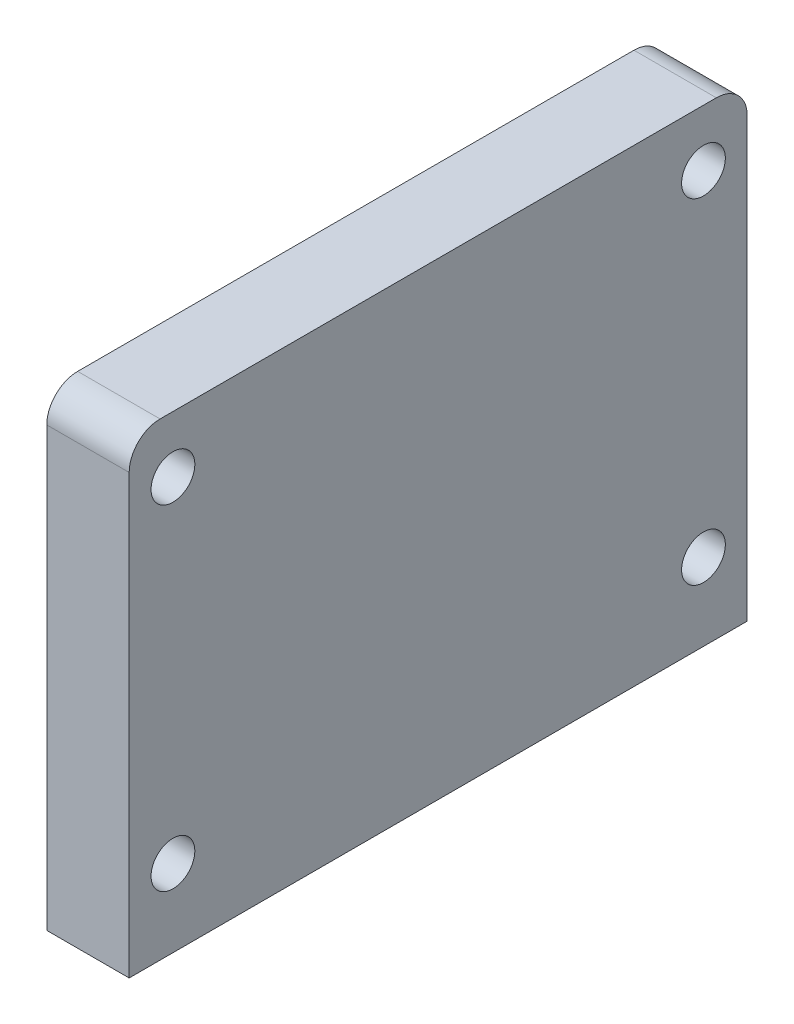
ISO-10303-21;
HEADER;
FILE_DESCRIPTION(('STEP AP214'),'2;1');
FILE_NAME('part.step','',(''),(''),'','','');
FILE_SCHEMA(('AUTOMOTIVE_DESIGN { 1 0 10303 214 1 1 1 1 }'));
ENDSEC;
DATA;
#1=APPLICATION_CONTEXT('core data for automotive mechanical design processes');
#2=APPLICATION_PROTOCOL_DEFINITION('international standard','automotive_design',2000,#1);
#3=PRODUCT_CONTEXT('',#1,'mechanical');
#4=PRODUCT('Part','Part','',(#3));
#5=PRODUCT_RELATED_PRODUCT_CATEGORY('part','',(#4));
#6=PRODUCT_DEFINITION_FORMATION('','',#4);
#7=PRODUCT_DEFINITION_CONTEXT('part definition',#1,'design');
#8=PRODUCT_DEFINITION('design','',#6,#7);
#9=PRODUCT_DEFINITION_SHAPE('','',#8);
#10=(LENGTH_UNIT() NAMED_UNIT(*) SI_UNIT(.MILLI.,.METRE.));
#11=(NAMED_UNIT(*) PLANE_ANGLE_UNIT() SI_UNIT($,.RADIAN.));
#12=(NAMED_UNIT(*) SI_UNIT($,.STERADIAN.) SOLID_ANGLE_UNIT());
#13=UNCERTAINTY_MEASURE_WITH_UNIT(LENGTH_MEASURE(1.E-05),#10,'distance_accuracy_value','');
#14=(GEOMETRIC_REPRESENTATION_CONTEXT(3) GLOBAL_UNCERTAINTY_ASSIGNED_CONTEXT((#13)) GLOBAL_UNIT_ASSIGNED_CONTEXT((#10,
#11,#12)) REPRESENTATION_CONTEXT('',''));
#15=CARTESIAN_POINT('',(0.,0.,0.));
#16=DIRECTION('',(0.,0.,1.));
#17=DIRECTION('',(1.,0.,0.));
#18=AXIS2_PLACEMENT_3D('',#15,#16,#17);
#19=CARTESIAN_POINT('',(-16.,37.,-54.));
#20=DIRECTION('',(1.,0.,0.));
#21=DIRECTION('',(0.,0.,-1.));
#22=AXIS2_PLACEMENT_3D('',#19,#20,#21);
#23=CYLINDRICAL_SURFACE('',#22,6.);
#24=CARTESIAN_POINT('',(0.,37.,-54.));
#25=DIRECTION('',(-1.,0.,0.));
#26=DIRECTION('',(0.,0.,1.));
#27=AXIS2_PLACEMENT_3D('',#24,#25,#26);
#28=CIRCLE('',#27,6.);
#29=CARTESIAN_POINT('',(0.,43.,-54.));
#30=VERTEX_POINT('',#29);
#31=CARTESIAN_POINT('',(0.,37.,-60.));
#32=VERTEX_POINT('',#31);
#33=EDGE_CURVE('E117',#30,#32,#28,.T.);
#34=ORIENTED_EDGE('',*,*,#33,.T.);
#35=DIRECTION('',(1.,0.,0.));
#36=VECTOR('',#35,1.);
#37=CARTESIAN_POINT('',(-16.,37.,-60.));
#38=LINE('',#37,#36);
#39=CARTESIAN_POINT('',(-16.,37.,-60.));
#40=VERTEX_POINT('',#39);
#41=EDGE_CURVE('E11',#40,#32,#38,.T.);
#42=ORIENTED_EDGE('',*,*,#41,.F.);
#43=CARTESIAN_POINT('',(-16.,37.,-54.));
#44=DIRECTION('',(-1.,0.,0.));
#45=DIRECTION('',(0.,0.,1.));
#46=AXIS2_PLACEMENT_3D('',#43,#44,#45);
#47=CIRCLE('',#46,6.);
#48=CARTESIAN_POINT('',(-16.,43.,-54.));
#49=VERTEX_POINT('',#48);
#50=EDGE_CURVE('E128',#49,#40,#47,.T.);
#51=ORIENTED_EDGE('',*,*,#50,.F.);
#52=DIRECTION('',(1.,0.,0.));
#53=VECTOR('',#52,1.);
#54=CARTESIAN_POINT('',(-16.,43.,-54.));
#55=LINE('',#54,#53);
#56=EDGE_CURVE('E113',#49,#30,#55,.T.);
#57=ORIENTED_EDGE('',*,*,#56,.T.);
#58=EDGE_LOOP('',(#34,#42,#51,#57));
#59=FACE_BOUND('',#58,.T.);
#60=ADVANCED_FACE('F33',(#59),#23,.T.);
#61=CARTESIAN_POINT('',(-16.,37.,-60.));
#62=DIRECTION('',(0.,0.,1.));
#63=DIRECTION('',(1.,0.,0.));
#64=AXIS2_PLACEMENT_3D('',#61,#62,#63);
#65=PLANE('',#64);
#66=DIRECTION('',(0.,-1.,0.));
#67=VECTOR('',#66,1.);
#68=CARTESIAN_POINT('',(0.,37.,-60.));
#69=LINE('',#68,#67);
#70=CARTESIAN_POINT('',(0.,-48.,-60.));
#71=VERTEX_POINT('',#70);
#72=EDGE_CURVE('E120',#32,#71,#69,.T.);
#73=ORIENTED_EDGE('',*,*,#72,.T.);
#74=DIRECTION('',(1.,0.,0.));
#75=VECTOR('',#74,1.);
#76=CARTESIAN_POINT('',(-16.,-48.,-60.));
#77=LINE('',#76,#75);
#78=CARTESIAN_POINT('',(-16.,-48.,-60.));
#79=VERTEX_POINT('',#78);
#80=EDGE_CURVE('E41',#79,#71,#77,.T.);
#81=ORIENTED_EDGE('',*,*,#80,.F.);
#82=DIRECTION('',(0.,-1.,0.));
#83=VECTOR('',#82,1.);
#84=CARTESIAN_POINT('',(-16.,37.,-60.));
#85=LINE('',#84,#83);
#86=EDGE_CURVE('E86',#40,#79,#85,.T.);
#87=ORIENTED_EDGE('',*,*,#86,.F.);
#88=ORIENTED_EDGE('',*,*,#41,.T.);
#89=EDGE_LOOP('',(#73,#81,#87,#88));
#90=FACE_BOUND('',#89,.T.);
#91=ADVANCED_FACE('F153',(#90),#65,.F.);
#92=CARTESIAN_POINT('',(-16.,-48.,60.));
#93=DIRECTION('',(0.,1.,0.));
#94=DIRECTION('',(0.,0.,1.));
#95=AXIS2_PLACEMENT_3D('',#92,#93,#94);
#96=PLANE('',#95);
#97=DIRECTION('',(0.,0.,1.));
#98=VECTOR('',#97,1.);
#99=CARTESIAN_POINT('',(0.,-48.,60.));
#100=LINE('',#99,#98);
#101=CARTESIAN_POINT('',(0.,-48.,60.));
#102=VERTEX_POINT('',#101);
#103=EDGE_CURVE('E123',#71,#102,#100,.T.);
#104=ORIENTED_EDGE('',*,*,#103,.T.);
#105=DIRECTION('',(1.,0.,0.));
#106=VECTOR('',#105,1.);
#107=CARTESIAN_POINT('',(-16.,-48.,60.));
#108=LINE('',#107,#106);
#109=CARTESIAN_POINT('',(-16.,-48.,60.));
#110=VERTEX_POINT('',#109);
#111=EDGE_CURVE('E108',#110,#102,#108,.T.);
#112=ORIENTED_EDGE('',*,*,#111,.F.);
#113=DIRECTION('',(0.,0.,1.));
#114=VECTOR('',#113,1.);
#115=CARTESIAN_POINT('',(-16.,-48.,60.));
#116=LINE('',#115,#114);
#117=EDGE_CURVE('E99',#79,#110,#116,.T.);
#118=ORIENTED_EDGE('',*,*,#117,.F.);
#119=ORIENTED_EDGE('',*,*,#80,.T.);
#120=EDGE_LOOP('',(#104,#112,#118,#119));
#121=FACE_BOUND('',#120,.T.);
#122=ADVANCED_FACE('F134',(#121),#96,.F.);
#123=CARTESIAN_POINT('',(-16.,37.,60.));
#124=DIRECTION('',(0.,0.,-1.));
#125=DIRECTION('',(-1.,0.,0.));
#126=AXIS2_PLACEMENT_3D('',#123,#124,#125);
#127=PLANE('',#126);
#128=DIRECTION('',(0.,1.,0.));
#129=VECTOR('',#128,1.);
#130=CARTESIAN_POINT('',(0.,37.,60.));
#131=LINE('',#130,#129);
#132=CARTESIAN_POINT('',(0.,37.,60.));
#133=VERTEX_POINT('',#132);
#134=EDGE_CURVE('E107',#102,#133,#131,.T.);
#135=ORIENTED_EDGE('',*,*,#134,.T.);
#136=DIRECTION('',(1.,0.,0.));
#137=VECTOR('',#136,1.);
#138=CARTESIAN_POINT('',(-16.,37.,60.));
#139=LINE('',#138,#137);
#140=CARTESIAN_POINT('',(-16.,37.,60.));
#141=VERTEX_POINT('',#140);
#142=EDGE_CURVE('E104',#141,#133,#139,.T.);
#143=ORIENTED_EDGE('',*,*,#142,.F.);
#144=DIRECTION('',(0.,1.,0.));
#145=VECTOR('',#144,1.);
#146=CARTESIAN_POINT('',(-16.,37.,60.));
#147=LINE('',#146,#145);
#148=EDGE_CURVE('E93',#110,#141,#147,.T.);
#149=ORIENTED_EDGE('',*,*,#148,.F.);
#150=ORIENTED_EDGE('',*,*,#111,.T.);
#151=EDGE_LOOP('',(#135,#143,#149,#150));
#152=FACE_BOUND('',#151,.T.);
#153=ADVANCED_FACE('F105',(#152),#127,.F.);
#154=CARTESIAN_POINT('',(-16.,37.,54.));
#155=DIRECTION('',(1.,0.,0.));
#156=DIRECTION('',(0.,0.,-1.));
#157=AXIS2_PLACEMENT_3D('',#154,#155,#156);
#158=CYLINDRICAL_SURFACE('',#157,6.);
#159=CARTESIAN_POINT('',(0.,37.,54.));
#160=DIRECTION('',(-1.,0.,0.));
#161=DIRECTION('',(0.,0.,1.));
#162=AXIS2_PLACEMENT_3D('',#159,#160,#161);
#163=CIRCLE('',#162,6.);
#164=CARTESIAN_POINT('',(0.,43.,54.));
#165=VERTEX_POINT('',#164);
#166=EDGE_CURVE('E72',#133,#165,#163,.T.);
#167=ORIENTED_EDGE('',*,*,#166,.T.);
#168=DIRECTION('',(1.,0.,0.));
#169=VECTOR('',#168,1.);
#170=CARTESIAN_POINT('',(-16.,43.,54.));
#171=LINE('',#170,#169);
#172=CARTESIAN_POINT('',(-16.,43.,54.));
#173=VERTEX_POINT('',#172);
#174=EDGE_CURVE('E109',#173,#165,#171,.T.);
#175=ORIENTED_EDGE('',*,*,#174,.F.);
#176=CARTESIAN_POINT('',(-16.,37.,54.));
#177=DIRECTION('',(-1.,0.,0.));
#178=DIRECTION('',(0.,0.,1.));
#179=AXIS2_PLACEMENT_3D('',#176,#177,#178);
#180=CIRCLE('',#179,6.);
#181=EDGE_CURVE('E97',#141,#173,#180,.T.);
#182=ORIENTED_EDGE('',*,*,#181,.F.);
#183=ORIENTED_EDGE('',*,*,#142,.T.);
#184=EDGE_LOOP('',(#167,#175,#182,#183));
#185=FACE_BOUND('',#184,.T.);
#186=ADVANCED_FACE('F111',(#185),#158,.T.);
#187=CARTESIAN_POINT('',(-16.,43.,54.));
#188=DIRECTION('',(0.,-1.,0.));
#189=DIRECTION('',(0.,0.,-1.));
#190=AXIS2_PLACEMENT_3D('',#187,#188,#189);
#191=PLANE('',#190);
#192=DIRECTION('',(0.,0.,-1.));
#193=VECTOR('',#192,1.);
#194=CARTESIAN_POINT('',(0.,43.,54.));
#195=LINE('',#194,#193);
#196=EDGE_CURVE('E78',#165,#30,#195,.T.);
#197=ORIENTED_EDGE('',*,*,#196,.T.);
#198=ORIENTED_EDGE('',*,*,#56,.F.);
#199=DIRECTION('',(0.,0.,-1.));
#200=VECTOR('',#199,1.);
#201=CARTESIAN_POINT('',(-16.,43.,54.));
#202=LINE('',#201,#200);
#203=EDGE_CURVE('E49',#173,#49,#202,.T.);
#204=ORIENTED_EDGE('',*,*,#203,.F.);
#205=ORIENTED_EDGE('',*,*,#174,.T.);
#206=EDGE_LOOP('',(#197,#198,#204,#205));
#207=FACE_BOUND('',#206,.T.);
#208=ADVANCED_FACE('F141',(#207),#191,.F.);
#209=CARTESIAN_POINT('',(-16.,37.,-54.));
#210=DIRECTION('',(-1.,0.,0.));
#211=DIRECTION('',(0.,0.,1.));
#212=AXIS2_PLACEMENT_3D('',#209,#210,#211);
#213=PLANE('',#212);
#214=CARTESIAN_POINT('',(-16.,32.,51.5));
#215=DIRECTION('',(-1.,0.,0.));
#216=DIRECTION('',(0.,0.,1.));
#217=AXIS2_PLACEMENT_3D('',#214,#215,#216);
#218=CIRCLE('',#217,4.25);
#219=CARTESIAN_POINT('',(-16.,32.,55.75));
#220=VERTEX_POINT('',#219);
#221=EDGE_CURVE('E236',#220,#220,#218,.T.);
#222=ORIENTED_EDGE('',*,*,#221,.F.);
#223=EDGE_LOOP('',(#222));
#224=FACE_BOUND('',#223,.T.);
#225=CARTESIAN_POINT('',(-16.,-33.,51.5));
#226=DIRECTION('',(-1.,0.,0.));
#227=DIRECTION('',(0.,0.,1.));
#228=AXIS2_PLACEMENT_3D('',#225,#226,#227);
#229=CIRCLE('',#228,4.24999999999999);
#230=CARTESIAN_POINT('',(-16.,-33.,55.75));
#231=VERTEX_POINT('',#230);
#232=EDGE_CURVE('E246',#231,#231,#229,.T.);
#233=ORIENTED_EDGE('',*,*,#232,.F.);
#234=EDGE_LOOP('',(#233));
#235=FACE_BOUND('',#234,.T.);
#236=CARTESIAN_POINT('',(-16.,32.,-51.5));
#237=DIRECTION('',(-1.,0.,0.));
#238=DIRECTION('',(0.,0.,1.));
#239=AXIS2_PLACEMENT_3D('',#236,#237,#238);
#240=CIRCLE('',#239,4.25);
#241=CARTESIAN_POINT('',(-16.,32.,-47.25));
#242=VERTEX_POINT('',#241);
#243=EDGE_CURVE('E252',#242,#242,#240,.T.);
#244=ORIENTED_EDGE('',*,*,#243,.F.);
#245=EDGE_LOOP('',(#244));
#246=FACE_BOUND('',#245,.T.);
#247=CARTESIAN_POINT('',(-16.,-33.,-51.5));
#248=DIRECTION('',(-1.,0.,0.));
#249=DIRECTION('',(0.,0.,1.));
#250=AXIS2_PLACEMENT_3D('',#247,#248,#249);
#251=CIRCLE('',#250,4.24999999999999);
#252=CARTESIAN_POINT('',(-16.,-33.,-47.25));
#253=VERTEX_POINT('',#252);
#254=EDGE_CURVE('E121',#253,#253,#251,.T.);
#255=ORIENTED_EDGE('',*,*,#254,.F.);
#256=EDGE_LOOP('',(#255));
#257=FACE_BOUND('',#256,.T.);
#258=ORIENTED_EDGE('',*,*,#50,.T.);
#259=ORIENTED_EDGE('',*,*,#86,.T.);
#260=ORIENTED_EDGE('',*,*,#117,.T.);
#261=ORIENTED_EDGE('',*,*,#148,.T.);
#262=ORIENTED_EDGE('',*,*,#181,.T.);
#263=ORIENTED_EDGE('',*,*,#203,.T.);
#264=EDGE_LOOP('',(#258,#259,#260,#261,#262,#263));
#265=FACE_BOUND('',#264,.T.);
#266=ADVANCED_FACE('F95',(#224,#235,#246,#257,#265),#213,.T.);
#267=CARTESIAN_POINT('',(0.,37.,-54.));
#268=DIRECTION('',(-1.,0.,0.));
#269=DIRECTION('',(0.,0.,1.));
#270=AXIS2_PLACEMENT_3D('',#267,#268,#269);
#271=PLANE('',#270);
#272=CARTESIAN_POINT('',(0.,32.,51.5));
#273=DIRECTION('',(1.,0.,0.));
#274=DIRECTION('',(0.,0.,-1.));
#275=AXIS2_PLACEMENT_3D('',#272,#273,#274);
#276=CIRCLE('',#275,4.25);
#277=CARTESIAN_POINT('',(0.,32.,47.25));
#278=VERTEX_POINT('',#277);
#279=EDGE_CURVE('E239',#278,#278,#276,.T.);
#280=ORIENTED_EDGE('',*,*,#279,.F.);
#281=EDGE_LOOP('',(#280));
#282=FACE_BOUND('',#281,.T.);
#283=CARTESIAN_POINT('',(0.,-33.,51.5));
#284=DIRECTION('',(1.,0.,0.));
#285=DIRECTION('',(0.,0.,-1.));
#286=AXIS2_PLACEMENT_3D('',#283,#284,#285);
#287=CIRCLE('',#286,4.25);
#288=CARTESIAN_POINT('',(0.,-33.,47.25));
#289=VERTEX_POINT('',#288);
#290=EDGE_CURVE('E241',#289,#289,#287,.T.);
#291=ORIENTED_EDGE('',*,*,#290,.F.);
#292=EDGE_LOOP('',(#291));
#293=FACE_BOUND('',#292,.T.);
#294=CARTESIAN_POINT('',(0.,32.,-51.5));
#295=DIRECTION('',(1.,0.,0.));
#296=DIRECTION('',(0.,0.,-1.));
#297=AXIS2_PLACEMENT_3D('',#294,#295,#296);
#298=CIRCLE('',#297,4.25);
#299=CARTESIAN_POINT('',(0.,32.,-55.75));
#300=VERTEX_POINT('',#299);
#301=EDGE_CURVE('E249',#300,#300,#298,.T.);
#302=ORIENTED_EDGE('',*,*,#301,.F.);
#303=EDGE_LOOP('',(#302));
#304=FACE_BOUND('',#303,.T.);
#305=CARTESIAN_POINT('',(0.,-33.,-51.5));
#306=DIRECTION('',(1.,0.,0.));
#307=DIRECTION('',(0.,0.,-1.));
#308=AXIS2_PLACEMENT_3D('',#305,#306,#307);
#309=CIRCLE('',#308,4.25);
#310=CARTESIAN_POINT('',(0.,-33.,-55.75));
#311=VERTEX_POINT('',#310);
#312=EDGE_CURVE('E255',#311,#311,#309,.T.);
#313=ORIENTED_EDGE('',*,*,#312,.F.);
#314=EDGE_LOOP('',(#313));
#315=FACE_BOUND('',#314,.T.);
#316=ORIENTED_EDGE('',*,*,#33,.F.);
#317=ORIENTED_EDGE('',*,*,#196,.F.);
#318=ORIENTED_EDGE('',*,*,#166,.F.);
#319=ORIENTED_EDGE('',*,*,#134,.F.);
#320=ORIENTED_EDGE('',*,*,#103,.F.);
#321=ORIENTED_EDGE('',*,*,#72,.F.);
#322=EDGE_LOOP('',(#316,#317,#318,#319,#320,#321));
#323=FACE_BOUND('',#322,.T.);
#324=ADVANCED_FACE('F137',(#282,#293,#304,#315,#323),#271,.F.);
#325=CARTESIAN_POINT('',(0.,-33.,-51.5));
#326=DIRECTION('',(1.,0.,0.));
#327=DIRECTION('',(0.,0.,-1.));
#328=AXIS2_PLACEMENT_3D('',#325,#326,#327);
#329=CYLINDRICAL_SURFACE('',#328,4.24999999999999);
#330=ORIENTED_EDGE('',*,*,#254,.T.);
#331=EDGE_LOOP('',(#330));
#332=FACE_BOUND('',#331,.T.);
#333=ORIENTED_EDGE('',*,*,#312,.T.);
#334=EDGE_LOOP('',(#333));
#335=FACE_BOUND('',#334,.T.);
#336=ADVANCED_FACE('F190',(#332,#335),#329,.F.);
#337=CARTESIAN_POINT('',(0.,32.,-51.5));
#338=DIRECTION('',(1.,0.,0.));
#339=DIRECTION('',(0.,0.,-1.));
#340=AXIS2_PLACEMENT_3D('',#337,#338,#339);
#341=CYLINDRICAL_SURFACE('',#340,4.25);
#342=ORIENTED_EDGE('',*,*,#243,.T.);
#343=EDGE_LOOP('',(#342));
#344=FACE_BOUND('',#343,.T.);
#345=ORIENTED_EDGE('',*,*,#301,.T.);
#346=EDGE_LOOP('',(#345));
#347=FACE_BOUND('',#346,.T.);
#348=ADVANCED_FACE('F199',(#344,#347),#341,.F.);
#349=CARTESIAN_POINT('',(0.,-33.,51.5));
#350=DIRECTION('',(1.,0.,0.));
#351=DIRECTION('',(0.,0.,-1.));
#352=AXIS2_PLACEMENT_3D('',#349,#350,#351);
#353=CYLINDRICAL_SURFACE('',#352,4.24999999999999);
#354=ORIENTED_EDGE('',*,*,#232,.T.);
#355=EDGE_LOOP('',(#354));
#356=FACE_BOUND('',#355,.T.);
#357=ORIENTED_EDGE('',*,*,#290,.T.);
#358=EDGE_LOOP('',(#357));
#359=FACE_BOUND('',#358,.T.);
#360=ADVANCED_FACE('F209',(#356,#359),#353,.F.);
#361=CARTESIAN_POINT('',(0.,32.,51.5));
#362=DIRECTION('',(1.,0.,0.));
#363=DIRECTION('',(0.,0.,-1.));
#364=AXIS2_PLACEMENT_3D('',#361,#362,#363);
#365=CYLINDRICAL_SURFACE('',#364,4.25);
#366=ORIENTED_EDGE('',*,*,#221,.T.);
#367=EDGE_LOOP('',(#366));
#368=FACE_BOUND('',#367,.T.);
#369=ORIENTED_EDGE('',*,*,#279,.T.);
#370=EDGE_LOOP('',(#369));
#371=FACE_BOUND('',#370,.T.);
#372=ADVANCED_FACE('F219',(#368,#371),#365,.F.);
#373=CLOSED_SHELL('',(#60,#91,#122,#153,#186,#208,#266,#324,#336,#348,#360,#372));
#374=MANIFOLD_SOLID_BREP('B2',#373);
#375=ADVANCED_BREP_SHAPE_REPRESENTATION('',(#18,#374),#14);
#376=SHAPE_DEFINITION_REPRESENTATION(#9,#375);
ENDSEC;
END-ISO-10303-21;
